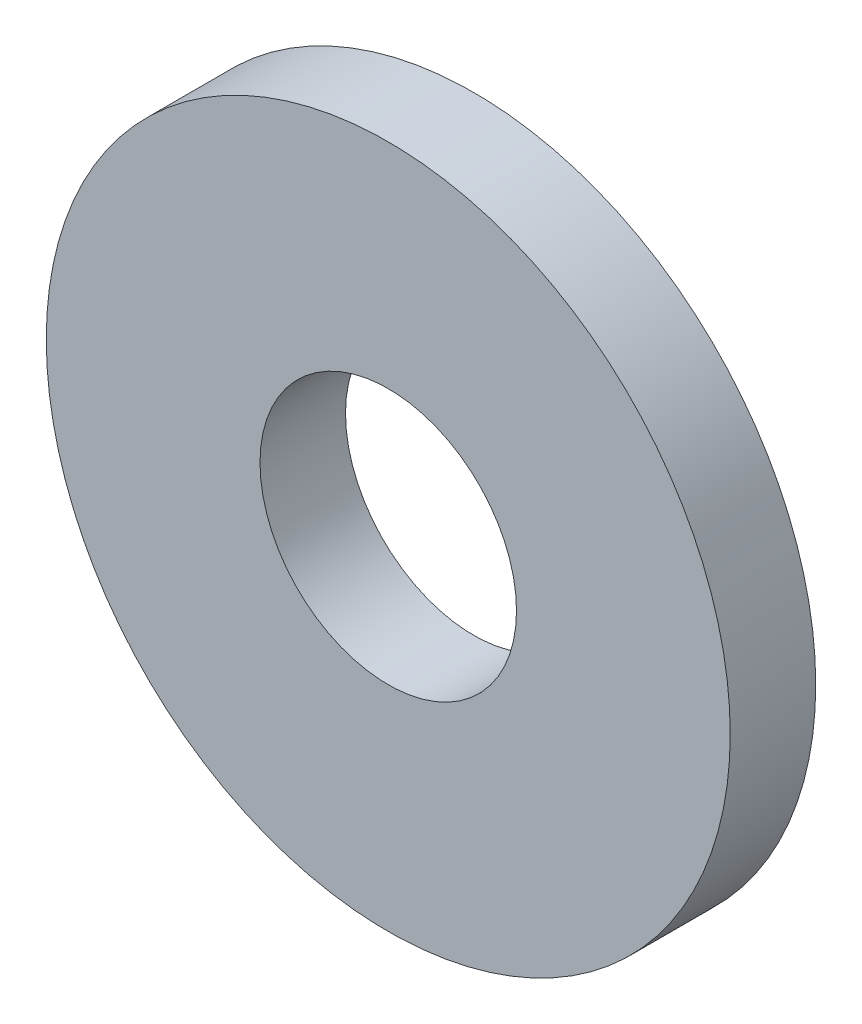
from build123d import *

# Parameters (mm, degrees)
ESQUISSE1_R          = 4
ESQUISSE1_R_2        = 1.5
BASE_EXTRUSION_DEPTH = 1


with BuildPart() as part:
    # Esquisse1 → Base-Extrusion (new body)
    with BuildSketch(Plane.XY):
        Circle(ESQUISSE1_R)
        Circle(ESQUISSE1_R_2, mode=Mode.SUBTRACT)
    extrude(amount=BASE_EXTRUSION_DEPTH)


solid = part.part
